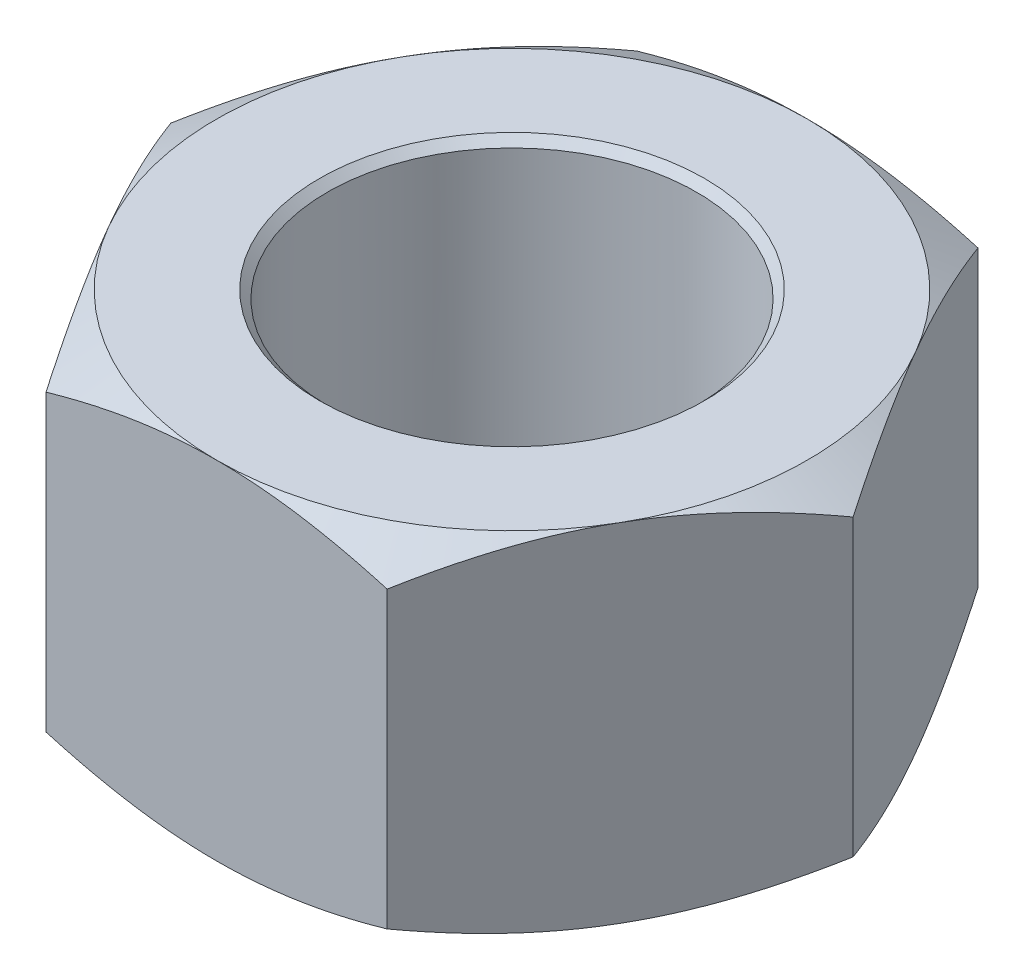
from build123d import *

# Parameters (mm, degrees)
ESQUISSE2_OUTSIDE_W      = 16.65
ESQUISSE2_OUTSIDE_H      = 16.65
HEXAGONE_DEPTH           = 4.7
CHANFREIN_INF_RIEUR_SIZE = 0.8
ESQUISSE3_R              = 2.5
ENL_V_MAT_EXTRU_1_DEPTH  = 8.708653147


with BuildPart() as part:
    # Esquisse1 → Base (revolve)
    with BuildSketch(Plane.XY, mode=Mode.PRIVATE) as base_sk:
        Polygon((1.807179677, 4.7), (4, 4.7), (5.656854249, 3.743414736), (5.656854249, 0.956585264), (4, 0), (1.807179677, 0), align=None)
    revolve(base_sk.sketch.rotate(Axis((0, 2.4, 0), (0, -1, 0)), 90), axis=Axis((0, 2.4, 0), (0, -1, 0)))

    # Esquisse2 outside → Hexagone (cut)
    with BuildSketch(Plane(origin=(0, 0, 0), x_dir=(1, 0, 0), z_dir=(0, 1, 0))):
        Rectangle(ESQUISSE2_OUTSIDE_W, ESQUISSE2_OUTSIDE_H)
        Polygon((-2.309401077, -4), (2.309401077, -4), (4.618802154, 0), (2.309401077, 4), (-2.309401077, 4), (-4.618802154, 0), align=None, mode=Mode.SUBTRACT)
    extrude(amount=HEXAGONE_DEPTH, mode=Mode.SUBTRACT)

    # Chanfrein inf_rieur
    chanfrein_inf_rieur_edges = [part.edges().sort_by_distance(p)[0] for p in [
        (0, 0, -1.807179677),
        (0, 4.7, -1.807179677),
    ]]
    chamfer(chanfrein_inf_rieur_edges, length=CHANFREIN_INF_RIEUR_SIZE)

    # Esquisse3 → Enl_v. mat.-Extru.1 (cut, through all)
    with BuildSketch(Plane(origin=(0, 4.7, 0), x_dir=(1, 0, 0), z_dir=(0, 1, 0))):
        with Locations(Location((0, 0, 0), (0, 0, 270))):
            Circle(ESQUISSE3_R)
    extrude(amount=-ENL_V_MAT_EXTRU_1_DEPTH, mode=Mode.SUBTRACT)


solid = part.part
